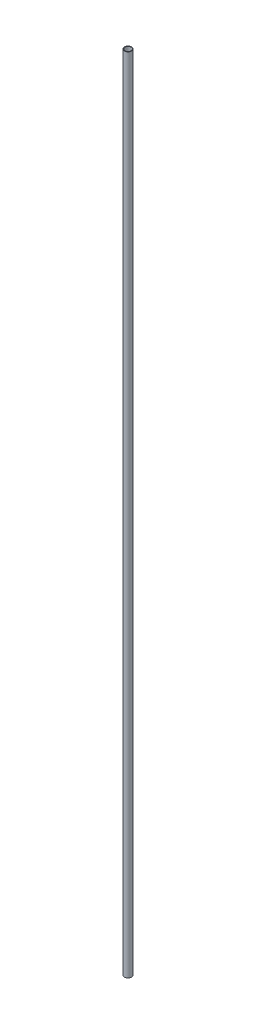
from build123d import *

# Parameters (mm, degrees)
SKETCH2_R           = 9.525
SKETCH2_R_2         = 8.255
BOSS_EXTRUDE1_DEPTH = 2108.2


with BuildPart() as part:
    # Sketch2 → Boss-Extrude1 (new body)
    with BuildSketch(Plane(origin=(0, 0, 0), x_dir=(1, 0, 0), z_dir=(0, 1, 0))):
        with Locations(Location((0, 0, 0), (0, 0, 270))):
            Circle(SKETCH2_R)
        with Locations(Location((0, 0, 0), (0, 0, 270))):
            Circle(SKETCH2_R_2, mode=Mode.SUBTRACT)
    extrude(amount=BOSS_EXTRUDE1_DEPTH)


solid = part.part
